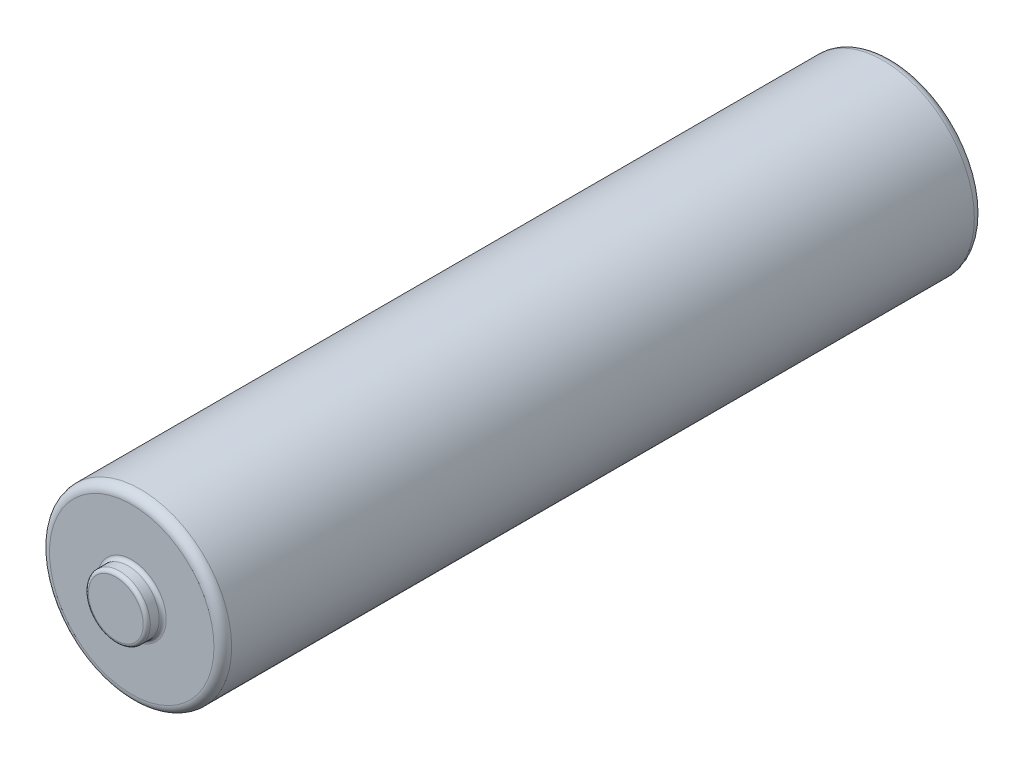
ISO-10303-21;
HEADER;
FILE_DESCRIPTION(('STEP AP214'),'2;1');
FILE_NAME('part.step','',(''),(''),'','','');
FILE_SCHEMA(('AUTOMOTIVE_DESIGN { 1 0 10303 214 1 1 1 1 }'));
ENDSEC;
DATA;
#1=APPLICATION_CONTEXT('core data for automotive mechanical design processes');
#2=APPLICATION_PROTOCOL_DEFINITION('international standard','automotive_design',2000,#1);
#3=PRODUCT_CONTEXT('',#1,'mechanical');
#4=PRODUCT('Part','Part','',(#3));
#5=PRODUCT_RELATED_PRODUCT_CATEGORY('part','',(#4));
#6=PRODUCT_DEFINITION_FORMATION('','',#4);
#7=PRODUCT_DEFINITION_CONTEXT('part definition',#1,'design');
#8=PRODUCT_DEFINITION('design','',#6,#7);
#9=PRODUCT_DEFINITION_SHAPE('','',#8);
#10=(LENGTH_UNIT() NAMED_UNIT(*) SI_UNIT(.MILLI.,.METRE.));
#11=(NAMED_UNIT(*) PLANE_ANGLE_UNIT() SI_UNIT($,.RADIAN.));
#12=(NAMED_UNIT(*) SI_UNIT($,.STERADIAN.) SOLID_ANGLE_UNIT());
#13=UNCERTAINTY_MEASURE_WITH_UNIT(LENGTH_MEASURE(1.E-05),#10,'distance_accuracy_value','');
#14=(GEOMETRIC_REPRESENTATION_CONTEXT(3) GLOBAL_UNCERTAINTY_ASSIGNED_CONTEXT((#13)) GLOBAL_UNIT_ASSIGNED_CONTEXT((#10,
#11,#12)) REPRESENTATION_CONTEXT('',''));
#15=CARTESIAN_POINT('',(0.,0.,0.));
#16=DIRECTION('',(0.,0.,1.));
#17=DIRECTION('',(1.,0.,0.));
#18=AXIS2_PLACEMENT_3D('',#15,#16,#17);
#19=CARTESIAN_POINT('',(0.,0.,43.));
#20=DIRECTION('',(0.,0.,1.));
#21=DIRECTION('',(1.,0.,0.));
#22=AXIS2_PLACEMENT_3D('',#19,#20,#21);
#23=PLANE('',#22);
#24=CARTESIAN_POINT('',(0.,0.,43.));
#25=DIRECTION('',(0.,0.,1.));
#26=DIRECTION('',(1.,0.,0.));
#27=AXIS2_PLACEMENT_3D('',#24,#25,#26);
#28=CIRCLE('',#27,4.65);
#29=CARTESIAN_POINT('',(4.65,0.,43.));
#30=VERTEX_POINT('',#29);
#31=EDGE_CURVE('E54',#30,#30,#28,.T.);
#32=ORIENTED_EDGE('',*,*,#31,.T.);
#33=EDGE_LOOP('',(#32));
#34=FACE_BOUND('',#33,.T.);
#35=CARTESIAN_POINT('',(0.,0.,43.));
#36=DIRECTION('',(0.,0.,1.));
#37=DIRECTION('',(1.,0.,0.));
#38=AXIS2_PLACEMENT_3D('',#35,#36,#37);
#39=CIRCLE('',#38,1.95);
#40=CARTESIAN_POINT('',(1.95,0.,43.));
#41=VERTEX_POINT('',#40);
#42=EDGE_CURVE('E60',#41,#41,#39,.F.);
#43=ORIENTED_EDGE('',*,*,#42,.T.);
#44=EDGE_LOOP('',(#43));
#45=FACE_BOUND('',#44,.T.);
#46=ADVANCED_FACE('F25',(#34,#45),#23,.T.);
#47=CARTESIAN_POINT('',(0.,0.,43.));
#48=DIRECTION('',(0.,0.,-1.));
#49=DIRECTION('',(-1.,0.,0.));
#50=AXIS2_PLACEMENT_3D('',#47,#48,#49);
#51=CYLINDRICAL_SURFACE('',#50,5.15);
#52=CARTESIAN_POINT('',(0.,0.,42.5));
#53=DIRECTION('',(0.,0.,1.));
#54=DIRECTION('',(1.,0.,0.));
#55=AXIS2_PLACEMENT_3D('',#52,#53,#54);
#56=CIRCLE('',#55,5.15);
#57=CARTESIAN_POINT('',(5.15,0.,42.5));
#58=VERTEX_POINT('',#57);
#59=EDGE_CURVE('E48',#58,#58,#56,.F.);
#60=ORIENTED_EDGE('',*,*,#59,.T.);
#61=EDGE_LOOP('',(#60));
#62=FACE_BOUND('',#61,.T.);
#63=CARTESIAN_POINT('',(0.,0.,0.5));
#64=DIRECTION('',(0.,0.,1.));
#65=DIRECTION('',(1.,0.,0.));
#66=AXIS2_PLACEMENT_3D('',#63,#64,#65);
#67=CIRCLE('',#66,5.15);
#68=CARTESIAN_POINT('',(5.15,0.,0.5));
#69=VERTEX_POINT('',#68);
#70=EDGE_CURVE('E51',#69,#69,#67,.T.);
#71=ORIENTED_EDGE('',*,*,#70,.T.);
#72=EDGE_LOOP('',(#71));
#73=FACE_BOUND('',#72,.T.);
#74=ADVANCED_FACE('F27',(#62,#73),#51,.T.);
#75=CARTESIAN_POINT('',(0.,0.,0.));
#76=DIRECTION('',(0.,0.,1.));
#77=DIRECTION('',(1.,0.,0.));
#78=AXIS2_PLACEMENT_3D('',#75,#76,#77);
#79=PLANE('',#78);
#80=CARTESIAN_POINT('',(0.,0.,0.));
#81=DIRECTION('',(0.,0.,-1.));
#82=DIRECTION('',(-1.,0.,0.));
#83=AXIS2_PLACEMENT_3D('',#80,#81,#82);
#84=CIRCLE('',#83,4.);
#85=CARTESIAN_POINT('',(-4.,0.,0.));
#86=VERTEX_POINT('',#85);
#87=EDGE_CURVE('E69',#86,#86,#84,.T.);
#88=ORIENTED_EDGE('',*,*,#87,.F.);
#89=EDGE_LOOP('',(#88));
#90=FACE_BOUND('',#89,.T.);
#91=CARTESIAN_POINT('',(0.,0.,0.));
#92=DIRECTION('',(0.,0.,1.));
#93=DIRECTION('',(1.,0.,0.));
#94=AXIS2_PLACEMENT_3D('',#91,#92,#93);
#95=CIRCLE('',#94,4.65);
#96=CARTESIAN_POINT('',(4.65,0.,0.));
#97=VERTEX_POINT('',#96);
#98=EDGE_CURVE('E45',#97,#97,#95,.F.);
#99=ORIENTED_EDGE('',*,*,#98,.T.);
#100=EDGE_LOOP('',(#99));
#101=FACE_BOUND('',#100,.T.);
#102=ADVANCED_FACE('F90',(#90,#101),#79,.F.);
#103=CARTESIAN_POINT('',(0.,0.,43.9));
#104=DIRECTION('',(0.,0.,-1.));
#105=DIRECTION('',(-1.,0.,0.));
#106=AXIS2_PLACEMENT_3D('',#103,#104,#105);
#107=CYLINDRICAL_SURFACE('',#106,1.75);
#108=CARTESIAN_POINT('',(0.,0.,43.2));
#109=DIRECTION('',(0.,0.,1.));
#110=DIRECTION('',(1.,0.,0.));
#111=AXIS2_PLACEMENT_3D('',#108,#109,#110);
#112=CIRCLE('',#111,1.75);
#113=CARTESIAN_POINT('',(1.75,0.,43.2));
#114=VERTEX_POINT('',#113);
#115=EDGE_CURVE('E63',#114,#114,#112,.T.);
#116=ORIENTED_EDGE('',*,*,#115,.T.);
#117=EDGE_LOOP('',(#116));
#118=FACE_BOUND('',#117,.T.);
#119=CARTESIAN_POINT('',(0.,0.,43.7));
#120=DIRECTION('',(0.,0.,1.));
#121=DIRECTION('',(1.,0.,0.));
#122=AXIS2_PLACEMENT_3D('',#119,#120,#121);
#123=CIRCLE('',#122,1.75);
#124=CARTESIAN_POINT('',(1.75,0.,43.7));
#125=VERTEX_POINT('',#124);
#126=EDGE_CURVE('E66',#125,#125,#123,.F.);
#127=ORIENTED_EDGE('',*,*,#126,.T.);
#128=EDGE_LOOP('',(#127));
#129=FACE_BOUND('',#128,.T.);
#130=ADVANCED_FACE('F104',(#118,#129),#107,.T.);
#131=CARTESIAN_POINT('',(0.,0.,43.9));
#132=DIRECTION('',(0.,0.,1.));
#133=DIRECTION('',(1.,0.,0.));
#134=AXIS2_PLACEMENT_3D('',#131,#132,#133);
#135=PLANE('',#134);
#136=CARTESIAN_POINT('',(0.,0.,43.9));
#137=DIRECTION('',(0.,0.,1.));
#138=DIRECTION('',(1.,0.,0.));
#139=AXIS2_PLACEMENT_3D('',#136,#137,#138);
#140=CIRCLE('',#139,1.55);
#141=CARTESIAN_POINT('',(1.55,0.,43.9));
#142=VERTEX_POINT('',#141);
#143=EDGE_CURVE('E57',#142,#142,#140,.T.);
#144=ORIENTED_EDGE('',*,*,#143,.T.);
#145=EDGE_LOOP('',(#144));
#146=FACE_BOUND('',#145,.T.);
#147=ADVANCED_FACE('F108',(#146),#135,.T.);
#148=CARTESIAN_POINT('',(0.,0.,43.2));
#149=DIRECTION('',(0.,0.,1.));
#150=DIRECTION('',(1.,0.,0.));
#151=AXIS2_PLACEMENT_3D('',#148,#149,#150);
#152=TOROIDAL_SURFACE('',#151,1.95,0.2);
#153=ORIENTED_EDGE('',*,*,#42,.F.);
#154=EDGE_LOOP('',(#153));
#155=FACE_BOUND('',#154,.T.);
#156=ORIENTED_EDGE('',*,*,#115,.F.);
#157=EDGE_LOOP('',(#156));
#158=FACE_BOUND('',#157,.T.);
#159=ADVANCED_FACE('F112',(#155,#158),#152,.F.);
#160=CARTESIAN_POINT('',(0.,0.,43.7));
#161=DIRECTION('',(0.,0.,1.));
#162=DIRECTION('',(1.,0.,0.));
#163=AXIS2_PLACEMENT_3D('',#160,#161,#162);
#164=TOROIDAL_SURFACE('',#163,1.55,0.2);
#165=ORIENTED_EDGE('',*,*,#126,.F.);
#166=EDGE_LOOP('',(#165));
#167=FACE_BOUND('',#166,.T.);
#168=ORIENTED_EDGE('',*,*,#143,.F.);
#169=EDGE_LOOP('',(#168));
#170=FACE_BOUND('',#169,.T.);
#171=ADVANCED_FACE('F116',(#167,#170),#164,.T.);
#172=CARTESIAN_POINT('',(0.,0.,42.5));
#173=DIRECTION('',(0.,0.,1.));
#174=DIRECTION('',(1.,0.,0.));
#175=AXIS2_PLACEMENT_3D('',#172,#173,#174);
#176=TOROIDAL_SURFACE('',#175,4.65,0.5);
#177=ORIENTED_EDGE('',*,*,#59,.F.);
#178=EDGE_LOOP('',(#177));
#179=FACE_BOUND('',#178,.T.);
#180=ORIENTED_EDGE('',*,*,#31,.F.);
#181=EDGE_LOOP('',(#180));
#182=FACE_BOUND('',#181,.T.);
#183=ADVANCED_FACE('F119',(#179,#182),#176,.T.);
#184=CARTESIAN_POINT('',(0.,0.,0.5));
#185=DIRECTION('',(0.,0.,1.));
#186=DIRECTION('',(1.,0.,0.));
#187=AXIS2_PLACEMENT_3D('',#184,#185,#186);
#188=TOROIDAL_SURFACE('',#187,4.65,0.5);
#189=ORIENTED_EDGE('',*,*,#98,.F.);
#190=EDGE_LOOP('',(#189));
#191=FACE_BOUND('',#190,.T.);
#192=ORIENTED_EDGE('',*,*,#70,.F.);
#193=EDGE_LOOP('',(#192));
#194=FACE_BOUND('',#193,.T.);
#195=ADVANCED_FACE('F123',(#191,#194),#188,.T.);
#196=CARTESIAN_POINT('',(0.,0.,0.1));
#197=DIRECTION('',(0.,0.,-1.));
#198=DIRECTION('',(-1.,0.,0.));
#199=AXIS2_PLACEMENT_3D('',#196,#197,#198);
#200=CYLINDRICAL_SURFACE('',#199,4.);
#201=CARTESIAN_POINT('',(0.,0.,0.05));
#202=DIRECTION('',(0.,0.,-1.));
#203=DIRECTION('',(-1.,0.,0.));
#204=AXIS2_PLACEMENT_3D('',#201,#202,#203);
#205=CIRCLE('',#204,4.);
#206=CARTESIAN_POINT('',(-4.,0.,0.05));
#207=VERTEX_POINT('',#206);
#208=EDGE_CURVE('E10',#207,#207,#205,.F.);
#209=ORIENTED_EDGE('',*,*,#208,.T.);
#210=EDGE_LOOP('',(#209));
#211=FACE_BOUND('',#210,.T.);
#212=ORIENTED_EDGE('',*,*,#87,.T.);
#213=EDGE_LOOP('',(#212));
#214=FACE_BOUND('',#213,.T.);
#215=ADVANCED_FACE('F91',(#211,#214),#200,.F.);
#216=CARTESIAN_POINT('',(0.,0.,0.1));
#217=DIRECTION('',(0.,0.,-1.));
#218=DIRECTION('',(-1.,0.,0.));
#219=AXIS2_PLACEMENT_3D('',#216,#217,#218);
#220=PLANE('',#219);
#221=CARTESIAN_POINT('',(0.,0.,0.1));
#222=DIRECTION('',(0.,0.,-1.));
#223=DIRECTION('',(-1.,0.,0.));
#224=AXIS2_PLACEMENT_3D('',#221,#222,#223);
#225=CIRCLE('',#224,3.05);
#226=CARTESIAN_POINT('',(-3.05,0.,0.1));
#227=VERTEX_POINT('',#226);
#228=EDGE_CURVE('E32',#227,#227,#225,.F.);
#229=ORIENTED_EDGE('',*,*,#228,.T.);
#230=EDGE_LOOP('',(#229));
#231=FACE_BOUND('',#230,.T.);
#232=CARTESIAN_POINT('',(0.,0.,0.1));
#233=DIRECTION('',(0.,0.,-1.));
#234=DIRECTION('',(-1.,0.,0.));
#235=AXIS2_PLACEMENT_3D('',#232,#233,#234);
#236=CIRCLE('',#235,3.95);
#237=CARTESIAN_POINT('',(-3.95,0.,0.1));
#238=VERTEX_POINT('',#237);
#239=EDGE_CURVE('E36',#238,#238,#236,.T.);
#240=ORIENTED_EDGE('',*,*,#239,.T.);
#241=EDGE_LOOP('',(#240));
#242=FACE_BOUND('',#241,.T.);
#243=ADVANCED_FACE('F80',(#231,#242),#220,.T.);
#244=CARTESIAN_POINT('',(0.,0.,0.1));
#245=DIRECTION('',(0.,0.,-1.));
#246=DIRECTION('',(-1.,0.,0.));
#247=AXIS2_PLACEMENT_3D('',#244,#245,#246);
#248=CYLINDRICAL_SURFACE('',#247,3.);
#249=CARTESIAN_POINT('',(0.,0.,0.05));
#250=DIRECTION('',(0.,0.,-1.));
#251=DIRECTION('',(-1.,0.,0.));
#252=AXIS2_PLACEMENT_3D('',#249,#250,#251);
#253=CIRCLE('',#252,3.);
#254=CARTESIAN_POINT('',(-3.,0.,0.05));
#255=VERTEX_POINT('',#254);
#256=EDGE_CURVE('E40',#255,#255,#253,.T.);
#257=ORIENTED_EDGE('',*,*,#256,.T.);
#258=EDGE_LOOP('',(#257));
#259=FACE_BOUND('',#258,.T.);
#260=CARTESIAN_POINT('',(0.,0.,0.));
#261=DIRECTION('',(0.,0.,-1.));
#262=DIRECTION('',(-1.,0.,0.));
#263=AXIS2_PLACEMENT_3D('',#260,#261,#262);
#264=CIRCLE('',#263,3.);
#265=CARTESIAN_POINT('',(-3.,0.,0.));
#266=VERTEX_POINT('',#265);
#267=EDGE_CURVE('E72',#266,#266,#264,.T.);
#268=ORIENTED_EDGE('',*,*,#267,.F.);
#269=EDGE_LOOP('',(#268));
#270=FACE_BOUND('',#269,.T.);
#271=ADVANCED_FACE('F78',(#259,#270),#248,.T.);
#272=ORIENTED_EDGE('',*,*,#267,.T.);
#273=EDGE_LOOP('',(#272));
#274=FACE_BOUND('',#273,.T.);
#275=ADVANCED_FACE('F76',(#274),#79,.F.);
#276=CARTESIAN_POINT('',(0.,0.,0.05));
#277=DIRECTION('',(0.,0.,-1.));
#278=DIRECTION('',(-1.,0.,0.));
#279=AXIS2_PLACEMENT_3D('',#276,#277,#278);
#280=TOROIDAL_SURFACE('',#279,3.05,0.05);
#281=ORIENTED_EDGE('',*,*,#228,.F.);
#282=EDGE_LOOP('',(#281));
#283=FACE_BOUND('',#282,.T.);
#284=ORIENTED_EDGE('',*,*,#256,.F.);
#285=EDGE_LOOP('',(#284));
#286=FACE_BOUND('',#285,.T.);
#287=ADVANCED_FACE('F88',(#283,#286),#280,.F.);
#288=CARTESIAN_POINT('',(0.,0.,0.05));
#289=DIRECTION('',(0.,0.,-1.));
#290=DIRECTION('',(-1.,0.,0.));
#291=AXIS2_PLACEMENT_3D('',#288,#289,#290);
#292=TOROIDAL_SURFACE('',#291,3.95,0.05);
#293=ORIENTED_EDGE('',*,*,#208,.F.);
#294=EDGE_LOOP('',(#293));
#295=FACE_BOUND('',#294,.T.);
#296=ORIENTED_EDGE('',*,*,#239,.F.);
#297=EDGE_LOOP('',(#296));
#298=FACE_BOUND('',#297,.T.);
#299=ADVANCED_FACE('F152',(#295,#298),#292,.F.);
#300=CLOSED_SHELL('',(#46,#74,#102,#130,#147,#159,#171,#183,#195,#215,#243,#271,#275,#287,#299));
#301=MANIFOLD_SOLID_BREP('B2',#300);
#302=ADVANCED_BREP_SHAPE_REPRESENTATION('',(#18,#301),#14);
#303=SHAPE_DEFINITION_REPRESENTATION(#9,#302);
ENDSEC;
END-ISO-10303-21;
